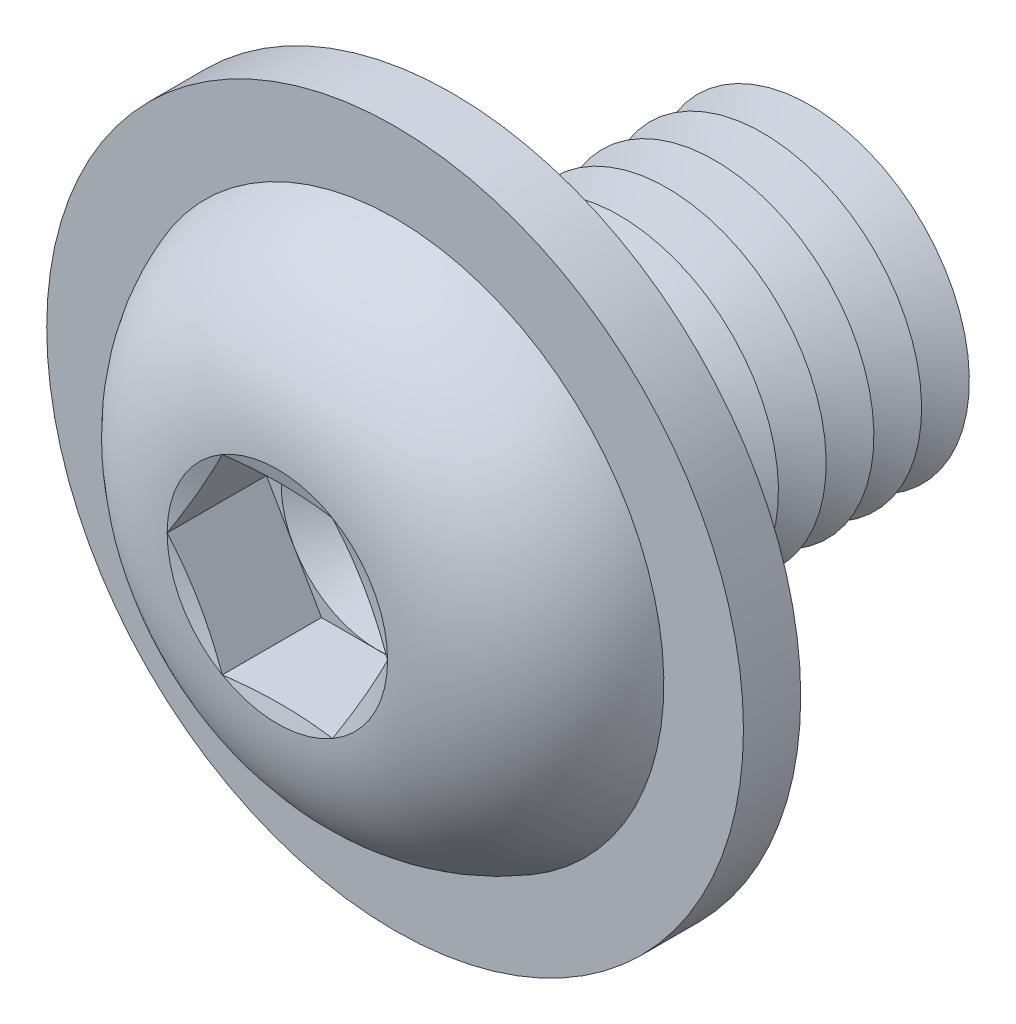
ISO-10303-21;
HEADER;
FILE_DESCRIPTION(('STEP AP214'),'2;1');
FILE_NAME('part.step','',(''),(''),'','','');
FILE_SCHEMA(('AUTOMOTIVE_DESIGN { 1 0 10303 214 1 1 1 1 }'));
ENDSEC;
DATA;
#1=APPLICATION_CONTEXT('core data for automotive mechanical design processes');
#2=APPLICATION_PROTOCOL_DEFINITION('international standard','automotive_design',2000,#1);
#3=PRODUCT_CONTEXT('',#1,'mechanical');
#4=PRODUCT('Part','Part','',(#3));
#5=PRODUCT_RELATED_PRODUCT_CATEGORY('part','',(#4));
#6=PRODUCT_DEFINITION_FORMATION('','',#4);
#7=PRODUCT_DEFINITION_CONTEXT('part definition',#1,'design');
#8=PRODUCT_DEFINITION('design','',#6,#7);
#9=PRODUCT_DEFINITION_SHAPE('','',#8);
#10=(LENGTH_UNIT() NAMED_UNIT(*) SI_UNIT(.MILLI.,.METRE.));
#11=(NAMED_UNIT(*) PLANE_ANGLE_UNIT() SI_UNIT($,.RADIAN.));
#12=(NAMED_UNIT(*) SI_UNIT($,.STERADIAN.) SOLID_ANGLE_UNIT());
#13=UNCERTAINTY_MEASURE_WITH_UNIT(LENGTH_MEASURE(1.E-05),#10,'distance_accuracy_value','');
#14=(GEOMETRIC_REPRESENTATION_CONTEXT(3) GLOBAL_UNCERTAINTY_ASSIGNED_CONTEXT((#13)) GLOBAL_UNIT_ASSIGNED_CONTEXT((#10,
#11,#12)) REPRESENTATION_CONTEXT('',''));
#15=CARTESIAN_POINT('',(0.,0.,0.));
#16=DIRECTION('',(0.,0.,1.));
#17=DIRECTION('',(1.,0.,0.));
#18=AXIS2_PLACEMENT_3D('',#15,#16,#17);
#19=CARTESIAN_POINT('',(0.,0.,-6.74999999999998));
#20=DIRECTION('',(0.,0.,1.));
#21=DIRECTION('',(0.,-1.,0.));
#22=AXIS2_PLACEMENT_3D('',#19,#20,#21);
#23=CONICAL_SURFACE('',#22,4.99999999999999,1.0471975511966);
#24=CARTESIAN_POINT('',(0.,0.,-7.49999999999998));
#25=DIRECTION('',(0.,0.,1.));
#26=DIRECTION('',(0.,-1.,0.));
#27=AXIS2_PLACEMENT_3D('',#24,#25,#26);
#28=CIRCLE('',#27,3.70096189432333);
#29=CARTESIAN_POINT('',(0.,-3.70096189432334,-7.49999999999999));
#30=VERTEX_POINT('',#29);
#31=EDGE_CURVE('E338',#30,#30,#28,.T.);
#32=ORIENTED_EDGE('',*,*,#31,.T.);
#33=EDGE_LOOP('',(#32));
#34=FACE_BOUND('',#33,.T.);
#35=CARTESIAN_POINT('',(0.,0.,-6.74999999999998));
#36=DIRECTION('',(0.,0.,1.));
#37=DIRECTION('',(0.,-1.,0.));
#38=AXIS2_PLACEMENT_3D('',#35,#36,#37);
#39=CIRCLE('',#38,4.99999999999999);
#40=CARTESIAN_POINT('',(0.,-5.,-6.74999999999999));
#41=VERTEX_POINT('',#40);
#42=EDGE_CURVE('E792',#41,#41,#39,.T.);
#43=ORIENTED_EDGE('',*,*,#42,.F.);
#44=EDGE_LOOP('',(#43));
#45=FACE_BOUND('',#44,.T.);
#46=ADVANCED_FACE('F39',(#34,#45),#23,.T.);
#47=CARTESIAN_POINT('',(0.,0.,-7.49999999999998));
#48=DIRECTION('',(0.,0.,-1.));
#49=DIRECTION('',(0.,1.,0.));
#50=AXIS2_PLACEMENT_3D('',#47,#48,#49);
#51=CONICAL_SURFACE('',#50,3.70096189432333,1.0471975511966);
#52=CARTESIAN_POINT('',(0.,0.,-8.24999999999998));
#53=DIRECTION('',(0.,0.,1.));
#54=DIRECTION('',(0.,-1.,0.));
#55=AXIS2_PLACEMENT_3D('',#52,#53,#54);
#56=CIRCLE('',#55,4.99999999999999);
#57=CARTESIAN_POINT('',(0.,-5.,-8.24999999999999));
#58=VERTEX_POINT('',#57);
#59=EDGE_CURVE('E326',#58,#58,#56,.T.);
#60=ORIENTED_EDGE('',*,*,#59,.T.);
#61=EDGE_LOOP('',(#60));
#62=FACE_BOUND('',#61,.T.);
#63=ORIENTED_EDGE('',*,*,#31,.F.);
#64=EDGE_LOOP('',(#63));
#65=FACE_BOUND('',#64,.T.);
#66=ADVANCED_FACE('F370',(#62,#65),#51,.T.);
#67=CARTESIAN_POINT('',(0.,4.99999999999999,-12.));
#68=DIRECTION('',(0.,0.,-1.));
#69=DIRECTION('',(0.,1.,0.));
#70=AXIS2_PLACEMENT_3D('',#67,#68,#69);
#71=PLANE('',#70);
#72=CARTESIAN_POINT('',(0.,0.,-12.));
#73=DIRECTION('',(0.,0.,1.));
#74=DIRECTION('',(0.,-1.,0.));
#75=AXIS2_PLACEMENT_3D('',#72,#73,#74);
#76=CIRCLE('',#75,3.70096189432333);
#77=CARTESIAN_POINT('',(0.,-3.70096189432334,-12.));
#78=VERTEX_POINT('',#77);
#79=EDGE_CURVE('E297',#78,#78,#76,.T.);
#80=ORIENTED_EDGE('',*,*,#79,.F.);
#81=EDGE_LOOP('',(#80));
#82=FACE_BOUND('',#81,.T.);
#83=ADVANCED_FACE('F368',(#82),#71,.T.);
#84=CARTESIAN_POINT('',(0.,0.,-11.25));
#85=DIRECTION('',(0.,0.,1.));
#86=DIRECTION('',(0.,-1.,0.));
#87=AXIS2_PLACEMENT_3D('',#84,#85,#86);
#88=CONICAL_SURFACE('',#87,4.99999999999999,1.0471975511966);
#89=ORIENTED_EDGE('',*,*,#79,.T.);
#90=EDGE_LOOP('',(#89));
#91=FACE_BOUND('',#90,.T.);
#92=CARTESIAN_POINT('',(0.,0.,-11.25));
#93=DIRECTION('',(0.,0.,1.));
#94=DIRECTION('',(0.,-1.,0.));
#95=AXIS2_PLACEMENT_3D('',#92,#93,#94);
#96=CIRCLE('',#95,4.99999999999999);
#97=CARTESIAN_POINT('',(0.,-4.99999999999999,-11.25));
#98=VERTEX_POINT('',#97);
#99=EDGE_CURVE('E355',#98,#98,#96,.T.);
#100=ORIENTED_EDGE('',*,*,#99,.F.);
#101=EDGE_LOOP('',(#100));
#102=FACE_BOUND('',#101,.T.);
#103=ADVANCED_FACE('F365',(#91,#102),#88,.T.);
#104=CARTESIAN_POINT('',(0.,0.,-10.5));
#105=DIRECTION('',(0.,0.,-1.));
#106=DIRECTION('',(0.,1.,0.));
#107=AXIS2_PLACEMENT_3D('',#104,#105,#106);
#108=CONICAL_SURFACE('',#107,3.70096189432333,1.0471975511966);
#109=ORIENTED_EDGE('',*,*,#99,.T.);
#110=EDGE_LOOP('',(#109));
#111=FACE_BOUND('',#110,.T.);
#112=CARTESIAN_POINT('',(0.,0.,-10.5));
#113=DIRECTION('',(0.,0.,1.));
#114=DIRECTION('',(0.,-1.,0.));
#115=AXIS2_PLACEMENT_3D('',#112,#113,#114);
#116=CIRCLE('',#115,3.70096189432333);
#117=CARTESIAN_POINT('',(0.,-3.70096189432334,-10.5));
#118=VERTEX_POINT('',#117);
#119=EDGE_CURVE('E349',#118,#118,#116,.T.);
#120=ORIENTED_EDGE('',*,*,#119,.F.);
#121=EDGE_LOOP('',(#120));
#122=FACE_BOUND('',#121,.T.);
#123=ADVANCED_FACE('F375',(#111,#122),#108,.T.);
#124=CARTESIAN_POINT('',(0.,0.,-9.74999999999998));
#125=DIRECTION('',(0.,0.,1.));
#126=DIRECTION('',(0.,-1.,0.));
#127=AXIS2_PLACEMENT_3D('',#124,#125,#126);
#128=CONICAL_SURFACE('',#127,4.99999999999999,1.0471975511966);
#129=ORIENTED_EDGE('',*,*,#119,.T.);
#130=EDGE_LOOP('',(#129));
#131=FACE_BOUND('',#130,.T.);
#132=CARTESIAN_POINT('',(0.,0.,-9.74999999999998));
#133=DIRECTION('',(0.,0.,1.));
#134=DIRECTION('',(0.,-1.,0.));
#135=AXIS2_PLACEMENT_3D('',#132,#133,#134);
#136=CIRCLE('',#135,4.99999999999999);
#137=CARTESIAN_POINT('',(0.,-5.,-9.74999999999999));
#138=VERTEX_POINT('',#137);
#139=EDGE_CURVE('E325',#138,#138,#136,.T.);
#140=ORIENTED_EDGE('',*,*,#139,.F.);
#141=EDGE_LOOP('',(#140));
#142=FACE_BOUND('',#141,.T.);
#143=ADVANCED_FACE('F392',(#131,#142),#128,.T.);
#144=CARTESIAN_POINT('',(0.,0.,-8.99999999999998));
#145=DIRECTION('',(0.,0.,-1.));
#146=DIRECTION('',(0.,1.,0.));
#147=AXIS2_PLACEMENT_3D('',#144,#145,#146);
#148=CONICAL_SURFACE('',#147,3.70096189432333,1.0471975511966);
#149=ORIENTED_EDGE('',*,*,#139,.T.);
#150=EDGE_LOOP('',(#149));
#151=FACE_BOUND('',#150,.T.);
#152=CARTESIAN_POINT('',(0.,0.,-8.99999999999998));
#153=DIRECTION('',(0.,0.,1.));
#154=DIRECTION('',(0.,-1.,0.));
#155=AXIS2_PLACEMENT_3D('',#152,#153,#154);
#156=CIRCLE('',#155,3.70096189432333);
#157=CARTESIAN_POINT('',(0.,-3.70096189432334,-8.99999999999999));
#158=VERTEX_POINT('',#157);
#159=EDGE_CURVE('E322',#158,#158,#156,.T.);
#160=ORIENTED_EDGE('',*,*,#159,.F.);
#161=EDGE_LOOP('',(#160));
#162=FACE_BOUND('',#161,.T.);
#163=ADVANCED_FACE('F388',(#151,#162),#148,.T.);
#164=CARTESIAN_POINT('',(0.,0.,-8.24999999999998));
#165=DIRECTION('',(0.,0.,1.));
#166=DIRECTION('',(0.,-1.,0.));
#167=AXIS2_PLACEMENT_3D('',#164,#165,#166);
#168=CONICAL_SURFACE('',#167,4.99999999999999,1.0471975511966);
#169=ORIENTED_EDGE('',*,*,#159,.T.);
#170=EDGE_LOOP('',(#169));
#171=FACE_BOUND('',#170,.T.);
#172=ORIENTED_EDGE('',*,*,#59,.F.);
#173=EDGE_LOOP('',(#172));
#174=FACE_BOUND('',#173,.T.);
#175=ADVANCED_FACE('F391',(#171,#174),#168,.T.);
#176=CARTESIAN_POINT('',(0.,0.,-5.24999999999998));
#177=DIRECTION('',(0.,0.,1.));
#178=DIRECTION('',(0.,-1.,0.));
#179=AXIS2_PLACEMENT_3D('',#176,#177,#178);
#180=CONICAL_SURFACE('',#179,4.99999999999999,1.0471975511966);
#181=CARTESIAN_POINT('',(0.,0.,-5.99999999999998));
#182=DIRECTION('',(0.,0.,1.));
#183=DIRECTION('',(0.,-1.,0.));
#184=AXIS2_PLACEMENT_3D('',#181,#182,#183);
#185=CIRCLE('',#184,3.70096189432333);
#186=CARTESIAN_POINT('',(0.,-3.70096189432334,-5.99999999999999));
#187=VERTEX_POINT('',#186);
#188=EDGE_CURVE('E789',#187,#187,#185,.T.);
#189=ORIENTED_EDGE('',*,*,#188,.T.);
#190=EDGE_LOOP('',(#189));
#191=FACE_BOUND('',#190,.T.);
#192=CARTESIAN_POINT('',(0.,0.,-5.24999999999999));
#193=DIRECTION('',(0.,0.,1.));
#194=DIRECTION('',(0.,-1.,0.));
#195=AXIS2_PLACEMENT_3D('',#192,#193,#194);
#196=CIRCLE('',#195,4.99999999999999);
#197=CARTESIAN_POINT('',(0.,-5.,-5.24999999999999));
#198=VERTEX_POINT('',#197);
#199=EDGE_CURVE('E333',#198,#198,#196,.T.);
#200=ORIENTED_EDGE('',*,*,#199,.F.);
#201=EDGE_LOOP('',(#200));
#202=FACE_BOUND('',#201,.T.);
#203=ADVANCED_FACE('F395',(#191,#202),#180,.T.);
#204=CARTESIAN_POINT('',(0.,0.,-5.99999999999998));
#205=DIRECTION('',(0.,0.,-1.));
#206=DIRECTION('',(0.,1.,0.));
#207=AXIS2_PLACEMENT_3D('',#204,#205,#206);
#208=CONICAL_SURFACE('',#207,3.70096189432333,1.0471975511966);
#209=ORIENTED_EDGE('',*,*,#42,.T.);
#210=EDGE_LOOP('',(#209));
#211=FACE_BOUND('',#210,.T.);
#212=ORIENTED_EDGE('',*,*,#188,.F.);
#213=EDGE_LOOP('',(#212));
#214=FACE_BOUND('',#213,.T.);
#215=ADVANCED_FACE('F419',(#211,#214),#208,.T.);
#216=CARTESIAN_POINT('',(0.,0.,-3.74999999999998));
#217=DIRECTION('',(0.,0.,1.));
#218=DIRECTION('',(0.,-1.,0.));
#219=AXIS2_PLACEMENT_3D('',#216,#217,#218);
#220=CONICAL_SURFACE('',#219,4.99999999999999,1.0471975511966);
#221=CARTESIAN_POINT('',(0.,0.,-4.49999999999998));
#222=DIRECTION('',(0.,0.,1.));
#223=DIRECTION('',(0.,-1.,0.));
#224=AXIS2_PLACEMENT_3D('',#221,#222,#223);
#225=CIRCLE('',#224,3.70096189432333);
#226=CARTESIAN_POINT('',(0.,-3.70096189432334,-4.49999999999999));
#227=VERTEX_POINT('',#226);
#228=EDGE_CURVE('E330',#227,#227,#225,.T.);
#229=ORIENTED_EDGE('',*,*,#228,.T.);
#230=EDGE_LOOP('',(#229));
#231=FACE_BOUND('',#230,.T.);
#232=CARTESIAN_POINT('',(0.,0.,-3.74999999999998));
#233=DIRECTION('',(0.,0.,1.));
#234=DIRECTION('',(0.,-1.,0.));
#235=AXIS2_PLACEMENT_3D('',#232,#233,#234);
#236=CIRCLE('',#235,4.99999999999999);
#237=CARTESIAN_POINT('',(0.,-5.,-3.74999999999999));
#238=VERTEX_POINT('',#237);
#239=EDGE_CURVE('E334',#238,#238,#236,.T.);
#240=ORIENTED_EDGE('',*,*,#239,.F.);
#241=EDGE_LOOP('',(#240));
#242=FACE_BOUND('',#241,.T.);
#243=ADVANCED_FACE('F425',(#231,#242),#220,.T.);
#244=CARTESIAN_POINT('',(0.,0.,-4.49999999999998));
#245=DIRECTION('',(0.,0.,-1.));
#246=DIRECTION('',(0.,1.,0.));
#247=AXIS2_PLACEMENT_3D('',#244,#245,#246);
#248=CONICAL_SURFACE('',#247,3.70096189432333,1.0471975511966);
#249=ORIENTED_EDGE('',*,*,#199,.T.);
#250=EDGE_LOOP('',(#249));
#251=FACE_BOUND('',#250,.T.);
#252=ORIENTED_EDGE('',*,*,#228,.F.);
#253=EDGE_LOOP('',(#252));
#254=FACE_BOUND('',#253,.T.);
#255=ADVANCED_FACE('F432',(#251,#254),#248,.T.);
#256=CARTESIAN_POINT('',(0.,0.,-2.24999999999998));
#257=DIRECTION('',(0.,0.,1.));
#258=DIRECTION('',(0.,-1.,0.));
#259=AXIS2_PLACEMENT_3D('',#256,#257,#258);
#260=CONICAL_SURFACE('',#259,4.99999999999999,1.0471975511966);
#261=CARTESIAN_POINT('',(0.,0.,-2.99999999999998));
#262=DIRECTION('',(0.,0.,1.));
#263=DIRECTION('',(0.,-1.,0.));
#264=AXIS2_PLACEMENT_3D('',#261,#262,#263);
#265=CIRCLE('',#264,3.70096189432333);
#266=CARTESIAN_POINT('',(0.,-3.70096189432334,-2.99999999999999));
#267=VERTEX_POINT('',#266);
#268=EDGE_CURVE('E345',#267,#267,#265,.T.);
#269=ORIENTED_EDGE('',*,*,#268,.T.);
#270=EDGE_LOOP('',(#269));
#271=FACE_BOUND('',#270,.T.);
#272=CARTESIAN_POINT('',(0.,0.,-2.24999999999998));
#273=DIRECTION('',(0.,0.,1.));
#274=DIRECTION('',(0.,-1.,0.));
#275=AXIS2_PLACEMENT_3D('',#272,#273,#274);
#276=CIRCLE('',#275,4.99999999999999);
#277=CARTESIAN_POINT('',(0.,-5.,-2.24999999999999));
#278=VERTEX_POINT('',#277);
#279=EDGE_CURVE('E346',#278,#278,#276,.T.);
#280=ORIENTED_EDGE('',*,*,#279,.F.);
#281=EDGE_LOOP('',(#280));
#282=FACE_BOUND('',#281,.T.);
#283=ADVANCED_FACE('F439',(#271,#282),#260,.T.);
#284=CARTESIAN_POINT('',(0.,0.,-2.99999999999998));
#285=DIRECTION('',(0.,0.,-1.));
#286=DIRECTION('',(0.,1.,0.));
#287=AXIS2_PLACEMENT_3D('',#284,#285,#286);
#288=CONICAL_SURFACE('',#287,3.70096189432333,1.0471975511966);
#289=ORIENTED_EDGE('',*,*,#239,.T.);
#290=EDGE_LOOP('',(#289));
#291=FACE_BOUND('',#290,.T.);
#292=ORIENTED_EDGE('',*,*,#268,.F.);
#293=EDGE_LOOP('',(#292));
#294=FACE_BOUND('',#293,.T.);
#295=ADVANCED_FACE('F446',(#291,#294),#288,.T.);
#296=CARTESIAN_POINT('',(0.,0.,-0.749999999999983));
#297=DIRECTION('',(0.,0.,1.));
#298=DIRECTION('',(0.,-1.,0.));
#299=AXIS2_PLACEMENT_3D('',#296,#297,#298);
#300=CONICAL_SURFACE('',#299,4.99999999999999,1.0471975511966);
#301=CARTESIAN_POINT('',(0.,0.,-1.49999999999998));
#302=DIRECTION('',(0.,0.,1.));
#303=DIRECTION('',(0.,-1.,0.));
#304=AXIS2_PLACEMENT_3D('',#301,#302,#303);
#305=CIRCLE('',#304,3.70096189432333);
#306=CARTESIAN_POINT('',(0.,-3.70096189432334,-1.49999999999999));
#307=VERTEX_POINT('',#306);
#308=EDGE_CURVE('E227',#307,#307,#305,.T.);
#309=ORIENTED_EDGE('',*,*,#308,.T.);
#310=EDGE_LOOP('',(#309));
#311=FACE_BOUND('',#310,.T.);
#312=CARTESIAN_POINT('',(0.,0.,-0.749999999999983));
#313=DIRECTION('',(0.,0.,1.));
#314=DIRECTION('',(0.,-1.,0.));
#315=AXIS2_PLACEMENT_3D('',#312,#313,#314);
#316=CIRCLE('',#315,4.99999999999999);
#317=CARTESIAN_POINT('',(0.,-5.,-0.749999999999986));
#318=VERTEX_POINT('',#317);
#319=EDGE_CURVE('E342',#318,#318,#316,.T.);
#320=ORIENTED_EDGE('',*,*,#319,.F.);
#321=EDGE_LOOP('',(#320));
#322=FACE_BOUND('',#321,.T.);
#323=ADVANCED_FACE('F453',(#311,#322),#300,.T.);
#324=CARTESIAN_POINT('',(0.,0.,-1.49999999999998));
#325=DIRECTION('',(0.,0.,-1.));
#326=DIRECTION('',(0.,1.,0.));
#327=AXIS2_PLACEMENT_3D('',#324,#325,#326);
#328=CONICAL_SURFACE('',#327,3.70096189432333,1.0471975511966);
#329=ORIENTED_EDGE('',*,*,#279,.T.);
#330=EDGE_LOOP('',(#329));
#331=FACE_BOUND('',#330,.T.);
#332=ORIENTED_EDGE('',*,*,#308,.F.);
#333=EDGE_LOOP('',(#332));
#334=FACE_BOUND('',#333,.T.);
#335=ADVANCED_FACE('F211',(#331,#334),#328,.T.);
#336=CARTESIAN_POINT('',(0.,4.99999999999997,0.));
#337=DIRECTION('',(0.,0.,-1.));
#338=DIRECTION('',(0.,1.,0.));
#339=AXIS2_PLACEMENT_3D('',#336,#337,#338);
#340=PLANE('',#339);
#341=CARTESIAN_POINT('',(0.,0.,0.));
#342=DIRECTION('',(0.,0.,-1.));
#343=DIRECTION('',(0.,1.,0.));
#344=AXIS2_PLACEMENT_3D('',#341,#342,#343);
#345=CIRCLE('',#344,5.74999999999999);
#346=CARTESIAN_POINT('',(0.,5.74999999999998,0.));
#347=VERTEX_POINT('',#346);
#348=EDGE_CURVE('E281',#347,#347,#345,.F.);
#349=ORIENTED_EDGE('',*,*,#348,.T.);
#350=EDGE_LOOP('',(#349));
#351=FACE_BOUND('',#350,.T.);
#352=CARTESIAN_POINT('',(0.,0.,0.));
#353=DIRECTION('',(0.,0.,-1.));
#354=DIRECTION('',(0.,1.,0.));
#355=AXIS2_PLACEMENT_3D('',#352,#353,#354);
#356=CIRCLE('',#355,10.95);
#357=CARTESIAN_POINT('',(0.,10.95,0.));
#358=VERTEX_POINT('',#357);
#359=EDGE_CURVE('E769',#358,#358,#356,.T.);
#360=ORIENTED_EDGE('',*,*,#359,.T.);
#361=EDGE_LOOP('',(#360));
#362=FACE_BOUND('',#361,.T.);
#363=ADVANCED_FACE('F465',(#351,#362),#340,.T.);
#364=CARTESIAN_POINT('',(0.,0.,-0.750000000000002));
#365=DIRECTION('',(0.,0.,-1.));
#366=DIRECTION('',(0.,1.,0.));
#367=AXIS2_PLACEMENT_3D('',#364,#365,#366);
#368=TOROIDAL_SURFACE('',#367,5.74999999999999,0.75);
#369=ORIENTED_EDGE('',*,*,#348,.F.);
#370=EDGE_LOOP('',(#369));
#371=FACE_BOUND('',#370,.T.);
#372=ORIENTED_EDGE('',*,*,#319,.T.);
#373=EDGE_LOOP('',(#372));
#374=FACE_BOUND('',#373,.T.);
#375=ADVANCED_FACE('F41',(#371,#374),#368,.F.);
#376=CARTESIAN_POINT('',(0.,0.,1.8));
#377=DIRECTION('',(0.,0.,-1.));
#378=DIRECTION('',(0.,1.,0.));
#379=AXIS2_PLACEMENT_3D('',#376,#377,#378);
#380=CYLINDRICAL_SURFACE('',#379,10.95);
#381=CARTESIAN_POINT('',(0.,0.,1.8));
#382=DIRECTION('',(0.,0.,-1.));
#383=DIRECTION('',(0.,1.,0.));
#384=AXIS2_PLACEMENT_3D('',#381,#382,#383);
#385=CIRCLE('',#384,10.95);
#386=CARTESIAN_POINT('',(0.,10.95,1.8));
#387=VERTEX_POINT('',#386);
#388=EDGE_CURVE('E765',#387,#387,#385,.T.);
#389=ORIENTED_EDGE('',*,*,#388,.T.);
#390=EDGE_LOOP('',(#389));
#391=FACE_BOUND('',#390,.T.);
#392=ORIENTED_EDGE('',*,*,#359,.F.);
#393=EDGE_LOOP('',(#392));
#394=FACE_BOUND('',#393,.T.);
#395=ADVANCED_FACE('F475',(#391,#394),#380,.T.);
#396=CARTESIAN_POINT('',(0.,0.,1.8));
#397=DIRECTION('',(0.,0.,-1.));
#398=DIRECTION('',(0.,1.,0.));
#399=AXIS2_PLACEMENT_3D('',#396,#397,#398);
#400=PLANE('',#399);
#401=CARTESIAN_POINT('',(0.,0.,1.8));
#402=DIRECTION('',(0.,0.,-1.));
#403=DIRECTION('',(0.,1.,0.));
#404=AXIS2_PLACEMENT_3D('',#401,#402,#403);
#405=CIRCLE('',#404,8.4473670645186);
#406=CARTESIAN_POINT('',(0.,8.44736706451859,1.8));
#407=VERTEX_POINT('',#406);
#408=EDGE_CURVE('E43',#407,#407,#405,.F.);
#409=ORIENTED_EDGE('',*,*,#408,.F.);
#410=EDGE_LOOP('',(#409));
#411=FACE_BOUND('',#410,.T.);
#412=ORIENTED_EDGE('',*,*,#388,.F.);
#413=EDGE_LOOP('',(#412));
#414=FACE_BOUND('',#413,.T.);
#415=ADVANCED_FACE('F117',(#411,#414),#400,.F.);
#416=CARTESIAN_POINT('',(0.,0.,2.38));
#417=DIRECTION('',(0.,0.,1.));
#418=DIRECTION('',(1.,0.,0.));
#419=AXIS2_PLACEMENT_3D('',#416,#417,#418);
#420=CONICAL_SURFACE('',#419,2.99999860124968,1.0471975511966);
#421=CARTESIAN_POINT('',(0.,0.,0.647950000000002));
#422=VERTEX_POINT('',#421);
#423=VERTEX_LOOP('',#422);
#424=FACE_BOUND('',#423,.T.);
#425=CARTESIAN_POINT('',(0.,0.,2.38));
#426=DIRECTION('',(0.,0.,1.));
#427=DIRECTION('',(1.,0.,0.));
#428=AXIS2_PLACEMENT_3D('',#425,#426,#427);
#429=CIRCLE('',#428,2.99999860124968);
#430=CARTESIAN_POINT('',(2.59807500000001,1.49999930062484,2.38));
#431=VERTEX_POINT('',#430);
#432=CARTESIAN_POINT('',(0.,2.99999860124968,2.38));
#433=VERTEX_POINT('',#432);
#434=EDGE_CURVE('E120',#431,#433,#429,.T.);
#435=ORIENTED_EDGE('',*,*,#434,.T.);
#436=CARTESIAN_POINT('',(0.,0.,2.38));
#437=DIRECTION('',(0.,0.,1.));
#438=DIRECTION('',(1.,0.,0.));
#439=AXIS2_PLACEMENT_3D('',#436,#437,#438);
#440=CIRCLE('',#439,2.99999860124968);
#441=CARTESIAN_POINT('',(-2.59807500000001,1.49999930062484,2.38));
#442=VERTEX_POINT('',#441);
#443=EDGE_CURVE('E11',#433,#442,#440,.T.);
#444=ORIENTED_EDGE('',*,*,#443,.T.);
#445=CARTESIAN_POINT('',(-2.59807500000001,-1.49999930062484,2.38));
#446=VERTEX_POINT('',#445);
#447=EDGE_CURVE('E49',#442,#446,#440,.T.);
#448=ORIENTED_EDGE('',*,*,#447,.T.);
#449=CARTESIAN_POINT('',(0.,-2.99999860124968,2.38));
#450=VERTEX_POINT('',#449);
#451=EDGE_CURVE('E284',#446,#450,#440,.T.);
#452=ORIENTED_EDGE('',*,*,#451,.T.);
#453=CARTESIAN_POINT('',(2.59807500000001,-1.49999930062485,2.38));
#454=VERTEX_POINT('',#453);
#455=EDGE_CURVE('E57',#450,#454,#440,.T.);
#456=ORIENTED_EDGE('',*,*,#455,.T.);
#457=EDGE_CURVE('E50',#454,#431,#440,.T.);
#458=ORIENTED_EDGE('',*,*,#457,.T.);
#459=EDGE_LOOP('',(#435,#444,#448,#452,#456,#458));
#460=FACE_BOUND('',#459,.T.);
#461=ADVANCED_FACE('F114',(#424,#460),#420,.F.);
#462=CARTESIAN_POINT('',(0.,0.,2.38));
#463=DIRECTION('',(0.,0.,1.));
#464=DIRECTION('',(1.,0.,0.));
#465=AXIS2_PLACEMENT_3D('',#462,#463,#464);
#466=PLANE('',#465);
#467=ORIENTED_EDGE('',*,*,#443,.F.);
#468=DIRECTION('',(-1.,0.,0.));
#469=VECTOR('',#468,1.);
#470=CARTESIAN_POINT('',(1.73205000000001,2.99999860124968,2.38));
#471=LINE('',#470,#469);
#472=CARTESIAN_POINT('',(-1.73205000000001,2.99999860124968,2.38));
#473=VERTEX_POINT('',#472);
#474=EDGE_CURVE('E132',#433,#473,#471,.T.);
#475=ORIENTED_EDGE('',*,*,#474,.T.);
#476=DIRECTION('',(-0.5,-0.866025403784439,0.));
#477=VECTOR('',#476,1.);
#478=CARTESIAN_POINT('',(-1.73205000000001,2.99999860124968,2.38));
#479=LINE('',#478,#477);
#480=EDGE_CURVE('E135',#473,#442,#479,.T.);
#481=ORIENTED_EDGE('',*,*,#480,.T.);
#482=EDGE_LOOP('',(#467,#475,#481));
#483=FACE_BOUND('',#482,.T.);
#484=ADVANCED_FACE('F116',(#483),#466,.T.);
#485=ORIENTED_EDGE('',*,*,#447,.F.);
#486=CARTESIAN_POINT('',(-3.46410000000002,0.,2.38));
#487=VERTEX_POINT('',#486);
#488=EDGE_CURVE('E145',#442,#487,#479,.T.);
#489=ORIENTED_EDGE('',*,*,#488,.T.);
#490=DIRECTION('',(0.5,-0.866025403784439,0.));
#491=VECTOR('',#490,1.);
#492=CARTESIAN_POINT('',(-3.46410000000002,0.,2.38));
#493=LINE('',#492,#491);
#494=EDGE_CURVE('E154',#487,#446,#493,.T.);
#495=ORIENTED_EDGE('',*,*,#494,.T.);
#496=EDGE_LOOP('',(#485,#489,#495));
#497=FACE_BOUND('',#496,.T.);
#498=ADVANCED_FACE('F496',(#497),#466,.T.);
#499=ORIENTED_EDGE('',*,*,#451,.F.);
#500=CARTESIAN_POINT('',(-1.73205000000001,-2.99999860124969,2.38));
#501=VERTEX_POINT('',#500);
#502=EDGE_CURVE('E153',#446,#501,#493,.T.);
#503=ORIENTED_EDGE('',*,*,#502,.T.);
#504=DIRECTION('',(1.,0.,0.));
#505=VECTOR('',#504,1.);
#506=CARTESIAN_POINT('',(-1.73205000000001,-2.99999860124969,2.38));
#507=LINE('',#506,#505);
#508=EDGE_CURVE('E159',#501,#450,#507,.T.);
#509=ORIENTED_EDGE('',*,*,#508,.T.);
#510=EDGE_LOOP('',(#499,#503,#509));
#511=FACE_BOUND('',#510,.T.);
#512=ADVANCED_FACE('F501',(#511),#466,.T.);
#513=ORIENTED_EDGE('',*,*,#455,.F.);
#514=CARTESIAN_POINT('',(1.73205000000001,-2.99999860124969,2.38));
#515=VERTEX_POINT('',#514);
#516=EDGE_CURVE('E158',#450,#515,#507,.T.);
#517=ORIENTED_EDGE('',*,*,#516,.T.);
#518=DIRECTION('',(0.5,0.866025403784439,0.));
#519=VECTOR('',#518,1.);
#520=CARTESIAN_POINT('',(1.73205000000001,-2.99999860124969,2.38));
#521=LINE('',#520,#519);
#522=EDGE_CURVE('E164',#515,#454,#521,.T.);
#523=ORIENTED_EDGE('',*,*,#522,.T.);
#524=EDGE_LOOP('',(#513,#517,#523));
#525=FACE_BOUND('',#524,.T.);
#526=ADVANCED_FACE('F507',(#525),#466,.T.);
#527=ORIENTED_EDGE('',*,*,#457,.F.);
#528=CARTESIAN_POINT('',(3.46410000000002,0.,2.38));
#529=VERTEX_POINT('',#528);
#530=EDGE_CURVE('E163',#454,#529,#521,.T.);
#531=ORIENTED_EDGE('',*,*,#530,.T.);
#532=DIRECTION('',(-0.5,0.866025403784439,0.));
#533=VECTOR('',#532,1.);
#534=CARTESIAN_POINT('',(3.46410000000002,0.,2.38));
#535=LINE('',#534,#533);
#536=EDGE_CURVE('E141',#529,#431,#535,.T.);
#537=ORIENTED_EDGE('',*,*,#536,.T.);
#538=EDGE_LOOP('',(#527,#531,#537));
#539=FACE_BOUND('',#538,.T.);
#540=ADVANCED_FACE('F513',(#539),#466,.T.);
#541=ORIENTED_EDGE('',*,*,#434,.F.);
#542=CARTESIAN_POINT('',(1.73205000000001,2.99999860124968,2.38));
#543=VERTEX_POINT('',#542);
#544=EDGE_CURVE('E127',#431,#543,#535,.T.);
#545=ORIENTED_EDGE('',*,*,#544,.T.);
#546=EDGE_CURVE('E137',#543,#433,#471,.T.);
#547=ORIENTED_EDGE('',*,*,#546,.T.);
#548=EDGE_LOOP('',(#541,#545,#547));
#549=FACE_BOUND('',#548,.T.);
#550=ADVANCED_FACE('F143',(#549),#466,.T.);
#551=CARTESIAN_POINT('',(1.73205000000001,2.99999860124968,2.38));
#552=DIRECTION('',(0.,1.,0.));
#553=DIRECTION('',(-1.,0.,0.));
#554=AXIS2_PLACEMENT_3D('',#551,#552,#553);
#555=PLANE('',#554);
#556=CARTESIAN_POINT('',(5.22730063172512,2.99999860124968,6.18672552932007));
#557=CARTESIAN_POINT('',(5.1007588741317,2.99999860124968,6.15732018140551));
#558=CARTESIAN_POINT('',(4.97415993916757,2.99999860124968,6.12816064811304));
#559=CARTESIAN_POINT('',(4.72082394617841,2.99999860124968,6.07043857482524));
#560=CARTESIAN_POINT('',(4.59408688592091,2.99999860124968,6.04187604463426));
#561=CARTESIAN_POINT('',(4.21358997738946,2.99999860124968,5.95723252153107));
#562=CARTESIAN_POINT('',(3.95959339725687,2.99999860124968,5.90220706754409));
#563=CARTESIAN_POINT('',(3.44835573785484,2.99999860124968,5.79574115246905));
#564=CARTESIAN_POINT('',(3.19110656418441,2.99999860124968,5.74433913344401));
#565=CARTESIAN_POINT('',(2.67540790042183,2.99999860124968,5.6477299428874));
#566=CARTESIAN_POINT('',(2.41695830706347,2.99999860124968,5.60252331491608));
#567=CARTESIAN_POINT('',(1.90555125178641,2.99999860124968,5.52251897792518));
#568=CARTESIAN_POINT('',(1.65263426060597,2.99999860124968,5.48747285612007));
#569=CARTESIAN_POINT('',(1.27220564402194,2.99999860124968,5.44439602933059));
#570=CARTESIAN_POINT('',(1.1452320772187,2.99999860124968,5.43161987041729));
#571=CARTESIAN_POINT('',(0.890973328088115,2.99999860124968,5.40972605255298));
#572=CARTESIAN_POINT('',(0.763688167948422,2.99999860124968,5.40060814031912));
#573=CARTESIAN_POINT('',(0.509442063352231,2.99999860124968,5.38647457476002));
#574=CARTESIAN_POINT('',(0.382482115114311,2.99999860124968,5.38144125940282));
#575=CARTESIAN_POINT('',(0.128463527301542,2.99999860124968,5.37566637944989));
#576=CARTESIAN_POINT('',(0.00140488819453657,2.99999860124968,5.37492479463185));
#577=CARTESIAN_POINT('',(-0.252672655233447,2.99999860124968,5.37777315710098));
#578=CARTESIAN_POINT('',(-0.379691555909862,2.99999860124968,5.38136342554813));
#579=CARTESIAN_POINT('',(-0.633540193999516,2.99999860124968,5.39268816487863));
#580=CARTESIAN_POINT('',(-0.760369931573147,2.99999860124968,5.40042263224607));
#581=CARTESIAN_POINT('',(-1.06836981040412,2.99999860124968,5.42382465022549));
#582=CARTESIAN_POINT('',(-1.24938929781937,2.99999860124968,5.44147485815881));
#583=CARTESIAN_POINT('',(-1.61066786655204,2.99999860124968,5.48312309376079));
#584=CARTESIAN_POINT('',(-1.79092697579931,2.99999860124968,5.50712088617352));
#585=CARTESIAN_POINT('',(-2.15127612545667,2.99999860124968,5.56013471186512));
#586=CARTESIAN_POINT('',(-2.33136383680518,2.99999860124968,5.58916634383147));
#587=CARTESIAN_POINT('',(-2.69089203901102,2.99999860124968,5.65100028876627));
#588=CARTESIAN_POINT('',(-2.870332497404,2.99999860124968,5.68380278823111));
#589=CARTESIAN_POINT('',(-3.23235399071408,2.99999860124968,5.75295369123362));
#590=CARTESIAN_POINT('',(-3.41492365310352,2.99999860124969,5.78936117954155));
#591=CARTESIAN_POINT('',(-3.77960351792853,2.99999860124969,5.864406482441));
#592=CARTESIAN_POINT('',(-3.96171371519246,2.99999860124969,5.90304432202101));
#593=CARTESIAN_POINT('',(-4.32457472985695,2.99999860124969,5.9817966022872));
#594=CARTESIAN_POINT('',(-4.50532755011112,2.99999860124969,6.02190185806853));
#595=CARTESIAN_POINT('',(-4.86652484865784,2.99999860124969,6.10342152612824));
#596=CARTESIAN_POINT('',(-5.04696934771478,2.99999860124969,6.14483584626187));
#597=CARTESIAN_POINT('',(-5.22730063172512,2.99999860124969,6.18672552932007));
#598=B_SPLINE_CURVE_WITH_KNOTS('',3,(#556,#557,#558,#559,#560,#561,#562,#563,#564,#565,#566,
#567,#568,#569,#570,#571,#572,#573,#574,#575,#576,#577,#578,#579,#580,#581,#582,#583,#584,#585,
#586,#587,#588,#589,#590,#591,#592,#593,#594,#595,#596,#597),.UNSPECIFIED.,.F.,.F.,(4,2,2,2,2,2,
2,2,2,2,2,2,2,2,2,2,2,2,2,2,4),(0.,0.389739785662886,0.77948596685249,1.55912928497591,
2.34608117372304,3.13310206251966,3.89884102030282,4.28164148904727,4.66441544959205,
5.04552531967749,5.42663339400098,5.80776972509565,6.18890573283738,6.734389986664,
7.27985402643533,7.82703956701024,8.37425218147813,8.93272720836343,9.49120849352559,
10.0466490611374,10.6020506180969),.UNSPECIFIED.);
#599=CARTESIAN_POINT('',(1.73204999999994,2.99999860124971,5.5));
#600=VERTEX_POINT('',#599);
#601=CARTESIAN_POINT('',(-1.73205000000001,2.99999860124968,5.5));
#602=VERTEX_POINT('',#601);
#603=EDGE_CURVE('E172',#600,#602,#598,.T.);
#604=ORIENTED_EDGE('',*,*,#603,.T.);
#605=DIRECTION('',(0.,0.,1.));
#606=VECTOR('',#605,1.);
#607=CARTESIAN_POINT('',(-1.73205000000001,2.99999860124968,2.38));
#608=LINE('',#607,#606);
#609=EDGE_CURVE('E139',#473,#602,#608,.T.);
#610=ORIENTED_EDGE('',*,*,#609,.F.);
#611=ORIENTED_EDGE('',*,*,#474,.F.);
#612=ORIENTED_EDGE('',*,*,#546,.F.);
#613=DIRECTION('',(0.,0.,1.));
#614=VECTOR('',#613,1.);
#615=CARTESIAN_POINT('',(1.73205000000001,2.99999860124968,2.38));
#616=LINE('',#615,#614);
#617=EDGE_CURVE('E65',#543,#600,#616,.T.);
#618=ORIENTED_EDGE('',*,*,#617,.T.);
#619=EDGE_LOOP('',(#604,#610,#611,#612,#618));
#620=FACE_BOUND('',#619,.T.);
#621=ADVANCED_FACE('F136',(#620),#555,.F.);
#622=CARTESIAN_POINT('',(-1.73205000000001,2.99999860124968,2.38));
#623=DIRECTION('',(-0.866025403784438,0.5,0.));
#624=DIRECTION('',(-0.5,-0.866025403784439,0.));
#625=AXIS2_PLACEMENT_3D('',#622,#623,#624);
#626=PLANE('',#625);
#627=CARTESIAN_POINT('',(-1.73193452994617,3.00019860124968,5.50003094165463));
#628=CARTESIAN_POINT('',(-1.8038717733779,2.87559964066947,5.48074619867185));
#629=CARTESIAN_POINT('',(-1.87593945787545,2.75077474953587,5.46323875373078));
#630=CARTESIAN_POINT('',(-2.02032937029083,2.50068408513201,5.43247971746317));
#631=CARTESIAN_POINT('',(-2.09265168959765,2.37541815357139,5.41922985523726));
#632=CARTESIAN_POINT('',(-2.23711232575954,2.12520499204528,5.39775958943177));
#633=CARTESIAN_POINT('',(-2.30924966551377,2.00025945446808,5.38951357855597));
#634=CARTESIAN_POINT('',(-2.45361635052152,1.75020902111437,5.37845651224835));
#635=CARTESIAN_POINT('',(-2.52584567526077,1.62510416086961,5.3756444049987));
#636=CARTESIAN_POINT('',(-2.67030432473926,1.37489444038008,5.3756444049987));
#637=CARTESIAN_POINT('',(-2.74253364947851,1.24978958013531,5.37845651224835));
#638=CARTESIAN_POINT('',(-2.88690033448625,0.999739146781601,5.38951357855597));
#639=CARTESIAN_POINT('',(-2.95903767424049,0.874793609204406,5.39775958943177));
#640=CARTESIAN_POINT('',(-3.10349831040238,0.62458044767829,5.41922985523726));
#641=CARTESIAN_POINT('',(-3.17582062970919,0.499314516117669,5.43247971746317));
#642=CARTESIAN_POINT('',(-3.32021054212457,0.249223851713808,5.46323875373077));
#643=CARTESIAN_POINT('',(-3.39227822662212,0.124398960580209,5.48074619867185));
#644=CARTESIAN_POINT('',(-3.46421547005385,-0.000200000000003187,5.50003094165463));
#645=B_SPLINE_CURVE_WITH_KNOTS('',3,(#627,#628,#629,#630,#631,#632,#633,#634,#635,#636,#637,
#638,#639,#640,#641,#642,#643,#644),.UNSPECIFIED.,.F.,.F.,(4,2,2,2,2,2,2,2,4),(0.,
0.435506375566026,0.871189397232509,1.30462357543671,1.73797384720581,2.17132411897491,
2.60475829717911,3.04044131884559,3.47594769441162),.UNSPECIFIED.);
#646=CARTESIAN_POINT('',(-3.46410000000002,0.,5.5));
#647=VERTEX_POINT('',#646);
#648=EDGE_CURVE('E235',#602,#647,#645,.T.);
#649=ORIENTED_EDGE('',*,*,#648,.T.);
#650=DIRECTION('',(0.,0.,1.));
#651=VECTOR('',#650,1.);
#652=CARTESIAN_POINT('',(-3.46410000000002,0.,2.38));
#653=LINE('',#652,#651);
#654=EDGE_CURVE('E174',#487,#647,#653,.T.);
#655=ORIENTED_EDGE('',*,*,#654,.F.);
#656=ORIENTED_EDGE('',*,*,#488,.F.);
#657=ORIENTED_EDGE('',*,*,#480,.F.);
#658=ORIENTED_EDGE('',*,*,#609,.T.);
#659=EDGE_LOOP('',(#649,#655,#656,#657,#658));
#660=FACE_BOUND('',#659,.T.);
#661=ADVANCED_FACE('F202',(#660),#626,.F.);
#662=CARTESIAN_POINT('',(-3.46410000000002,0.,2.38));
#663=DIRECTION('',(-0.866025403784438,-0.5,0.));
#664=DIRECTION('',(0.5,-0.866025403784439,0.));
#665=AXIS2_PLACEMENT_3D('',#662,#663,#664);
#666=PLANE('',#665);
#667=CARTESIAN_POINT('',(-3.46421547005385,0.000199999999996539,5.50003094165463));
#668=CARTESIAN_POINT('',(-3.39227822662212,-0.124398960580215,5.48074619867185));
#669=CARTESIAN_POINT('',(-3.32021054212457,-0.249223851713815,5.46323875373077));
#670=CARTESIAN_POINT('',(-3.17582062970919,-0.499314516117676,5.43247971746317));
#671=CARTESIAN_POINT('',(-3.10349831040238,-0.624580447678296,5.41922985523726));
#672=CARTESIAN_POINT('',(-2.95903767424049,-0.874793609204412,5.39775958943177));
#673=CARTESIAN_POINT('',(-2.88690033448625,-0.999739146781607,5.38951357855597));
#674=CARTESIAN_POINT('',(-2.7425336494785,-1.24978958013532,5.37845651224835));
#675=CARTESIAN_POINT('',(-2.67030432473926,-1.37489444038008,5.37564440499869));
#676=CARTESIAN_POINT('',(-2.52584567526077,-1.62510416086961,5.37564440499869));
#677=CARTESIAN_POINT('',(-2.45361635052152,-1.75020902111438,5.37845651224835));
#678=CARTESIAN_POINT('',(-2.30924966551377,-2.00025945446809,5.38951357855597));
#679=CARTESIAN_POINT('',(-2.23711232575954,-2.12520499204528,5.39775958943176));
#680=CARTESIAN_POINT('',(-2.09265168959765,-2.3754181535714,5.41922985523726));
#681=CARTESIAN_POINT('',(-2.02032937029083,-2.50068408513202,5.43247971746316));
#682=CARTESIAN_POINT('',(-1.87593945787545,-2.75077474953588,5.46323875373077));
#683=CARTESIAN_POINT('',(-1.8038717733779,-2.87559964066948,5.48074619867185));
#684=CARTESIAN_POINT('',(-1.73193452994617,-3.00019860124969,5.50003094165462));
#685=B_SPLINE_CURVE_WITH_KNOTS('',3,(#667,#668,#669,#670,#671,#672,#673,#674,#675,#676,#677,
#678,#679,#680,#681,#682,#683,#684),.UNSPECIFIED.,.F.,.F.,(4,2,2,2,2,2,2,2,4),(0.,
0.435506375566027,0.871189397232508,1.30462357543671,1.73797384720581,2.17132411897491,
2.60475829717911,3.04044131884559,3.47594769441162),.UNSPECIFIED.);
#686=CARTESIAN_POINT('',(-1.73205000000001,-2.99999860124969,5.5));
#687=VERTEX_POINT('',#686);
#688=EDGE_CURVE('E238',#647,#687,#685,.T.);
#689=ORIENTED_EDGE('',*,*,#688,.T.);
#690=DIRECTION('',(0.,0.,1.));
#691=VECTOR('',#690,1.);
#692=CARTESIAN_POINT('',(-1.73205000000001,-2.99999860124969,2.38));
#693=LINE('',#692,#691);
#694=EDGE_CURVE('E178',#501,#687,#693,.T.);
#695=ORIENTED_EDGE('',*,*,#694,.F.);
#696=ORIENTED_EDGE('',*,*,#502,.F.);
#697=ORIENTED_EDGE('',*,*,#494,.F.);
#698=ORIENTED_EDGE('',*,*,#654,.T.);
#699=EDGE_LOOP('',(#689,#695,#696,#697,#698));
#700=FACE_BOUND('',#699,.T.);
#701=ADVANCED_FACE('F256',(#700),#666,.F.);
#702=CARTESIAN_POINT('',(-1.73205000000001,-2.99999860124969,2.38));
#703=DIRECTION('',(0.,-1.,0.));
#704=DIRECTION('',(1.,0.,0.));
#705=AXIS2_PLACEMENT_3D('',#702,#703,#704);
#706=PLANE('',#705);
#707=CARTESIAN_POINT('',(-5.22730063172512,-2.99999860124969,6.18672552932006));
#708=CARTESIAN_POINT('',(-5.1007588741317,-2.99999860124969,6.15732018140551));
#709=CARTESIAN_POINT('',(-4.97415993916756,-2.99999860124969,6.12816064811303));
#710=CARTESIAN_POINT('',(-4.7208239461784,-2.99999860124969,6.07043857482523));
#711=CARTESIAN_POINT('',(-4.59408688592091,-2.99999860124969,6.04187604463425));
#712=CARTESIAN_POINT('',(-4.21358997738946,-2.99999860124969,5.95723252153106));
#713=CARTESIAN_POINT('',(-3.95959339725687,-2.99999860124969,5.90220706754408));
#714=CARTESIAN_POINT('',(-3.44835573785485,-2.99999860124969,5.79574115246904));
#715=CARTESIAN_POINT('',(-3.19110656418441,-2.99999860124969,5.744339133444));
#716=CARTESIAN_POINT('',(-2.67540790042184,-2.99999860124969,5.64772994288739));
#717=CARTESIAN_POINT('',(-2.41695830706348,-2.99999860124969,5.60252331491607));
#718=CARTESIAN_POINT('',(-1.90555125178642,-2.99999860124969,5.52251897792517));
#719=CARTESIAN_POINT('',(-1.65263426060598,-2.99999860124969,5.48747285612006));
#720=CARTESIAN_POINT('',(-1.27220564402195,-2.99999860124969,5.44439602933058));
#721=CARTESIAN_POINT('',(-1.14523207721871,-2.99999860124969,5.43161987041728));
#722=CARTESIAN_POINT('',(-0.890973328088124,-2.99999860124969,5.40972605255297));
#723=CARTESIAN_POINT('',(-0.763688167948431,-2.99999860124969,5.40060814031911));
#724=CARTESIAN_POINT('',(-0.509442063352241,-2.99999860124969,5.38647457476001));
#725=CARTESIAN_POINT('',(-0.382482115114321,-2.99999860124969,5.38144125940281));
#726=CARTESIAN_POINT('',(-0.128463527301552,-2.99999860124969,5.37566637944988));
#727=CARTESIAN_POINT('',(-0.0014048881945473,-2.99999860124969,5.37492479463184));
#728=CARTESIAN_POINT('',(0.252672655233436,-2.99999860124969,5.37777315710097));
#729=CARTESIAN_POINT('',(0.379691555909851,-2.99999860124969,5.38136342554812));
#730=CARTESIAN_POINT('',(0.633540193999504,-2.99999860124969,5.39268816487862));
#731=CARTESIAN_POINT('',(0.760369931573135,-2.99999860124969,5.40042263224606));
#732=CARTESIAN_POINT('',(1.06836981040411,-2.99999860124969,5.42382465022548));
#733=CARTESIAN_POINT('',(1.24938929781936,-2.99999860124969,5.4414748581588));
#734=CARTESIAN_POINT('',(1.61066786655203,-2.99999860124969,5.48312309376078));
#735=CARTESIAN_POINT('',(1.7909269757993,-2.99999860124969,5.50712088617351));
#736=CARTESIAN_POINT('',(2.15127612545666,-2.99999860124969,5.56013471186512));
#737=CARTESIAN_POINT('',(2.33136383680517,-2.99999860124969,5.58916634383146));
#738=CARTESIAN_POINT('',(2.69089203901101,-2.99999860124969,5.65100028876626));
#739=CARTESIAN_POINT('',(2.87033249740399,-2.99999860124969,5.6838027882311));
#740=CARTESIAN_POINT('',(3.23235399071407,-2.99999860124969,5.75295369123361));
#741=CARTESIAN_POINT('',(3.41492365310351,-2.99999860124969,5.78936117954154));
#742=CARTESIAN_POINT('',(3.77960351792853,-2.99999860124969,5.86440648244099));
#743=CARTESIAN_POINT('',(3.96171371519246,-2.99999860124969,5.903044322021));
#744=CARTESIAN_POINT('',(4.32457472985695,-2.99999860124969,5.98179660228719));
#745=CARTESIAN_POINT('',(4.50532755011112,-2.99999860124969,6.02190185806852));
#746=CARTESIAN_POINT('',(4.86652484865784,-2.99999860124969,6.10342152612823));
#747=CARTESIAN_POINT('',(5.04696934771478,-2.99999860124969,6.14483584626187));
#748=CARTESIAN_POINT('',(5.22730063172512,-2.99999860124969,6.18672552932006));
#749=B_SPLINE_CURVE_WITH_KNOTS('',3,(#707,#708,#709,#710,#711,#712,#713,#714,#715,#716,#717,
#718,#719,#720,#721,#722,#723,#724,#725,#726,#727,#728,#729,#730,#731,#732,#733,#734,#735,#736,
#737,#738,#739,#740,#741,#742,#743,#744,#745,#746,#747,#748),.UNSPECIFIED.,.F.,.F.,(4,2,2,2,2,2,
2,2,2,2,2,2,2,2,2,2,2,2,2,2,4),(0.,0.389739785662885,0.779485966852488,1.55912928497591,
2.34608117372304,3.13310206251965,3.89884102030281,4.28164148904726,4.66441544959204,
5.04552531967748,5.42663339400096,5.80776972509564,6.18890573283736,6.73438998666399,
7.27985402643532,7.82703956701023,8.37425218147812,8.93272720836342,9.49120849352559,
10.0466490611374,10.6020506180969),.UNSPECIFIED.);
#750=CARTESIAN_POINT('',(1.73205000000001,-2.99999860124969,5.5));
#751=VERTEX_POINT('',#750);
#752=EDGE_CURVE('E243',#687,#751,#749,.T.);
#753=ORIENTED_EDGE('',*,*,#752,.T.);
#754=DIRECTION('',(0.,0.,1.));
#755=VECTOR('',#754,1.);
#756=CARTESIAN_POINT('',(1.73205000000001,-2.99999860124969,2.38));
#757=LINE('',#756,#755);
#758=EDGE_CURVE('E173',#515,#751,#757,.T.);
#759=ORIENTED_EDGE('',*,*,#758,.F.);
#760=ORIENTED_EDGE('',*,*,#516,.F.);
#761=ORIENTED_EDGE('',*,*,#508,.F.);
#762=ORIENTED_EDGE('',*,*,#694,.T.);
#763=EDGE_LOOP('',(#753,#759,#760,#761,#762));
#764=FACE_BOUND('',#763,.T.);
#765=ADVANCED_FACE('F253',(#764),#706,.F.);
#766=CARTESIAN_POINT('',(1.73205000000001,-2.99999860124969,2.38));
#767=DIRECTION('',(0.866025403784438,-0.5,0.));
#768=DIRECTION('',(0.5,0.866025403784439,0.));
#769=AXIS2_PLACEMENT_3D('',#766,#767,#768);
#770=PLANE('',#769);
#771=CARTESIAN_POINT('',(1.73193452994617,-3.00019860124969,5.50003094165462));
#772=CARTESIAN_POINT('',(1.8038717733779,-2.87559964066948,5.48074619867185));
#773=CARTESIAN_POINT('',(1.87593945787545,-2.75077474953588,5.46323875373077));
#774=CARTESIAN_POINT('',(2.02032937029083,-2.50068408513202,5.43247971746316));
#775=CARTESIAN_POINT('',(2.09265168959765,-2.3754181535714,5.41922985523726));
#776=CARTESIAN_POINT('',(2.23711232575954,-2.12520499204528,5.39775958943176));
#777=CARTESIAN_POINT('',(2.30924966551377,-2.00025945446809,5.38951357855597));
#778=CARTESIAN_POINT('',(2.45361635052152,-1.75020902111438,5.37845651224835));
#779=CARTESIAN_POINT('',(2.52584567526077,-1.62510416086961,5.37564440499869));
#780=CARTESIAN_POINT('',(2.67030432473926,-1.37489444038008,5.37564440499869));
#781=CARTESIAN_POINT('',(2.74253364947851,-1.24978958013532,5.37845651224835));
#782=CARTESIAN_POINT('',(2.88690033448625,-0.999739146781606,5.38951357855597));
#783=CARTESIAN_POINT('',(2.95903767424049,-0.874793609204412,5.39775958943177));
#784=CARTESIAN_POINT('',(3.10349831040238,-0.624580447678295,5.41922985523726));
#785=CARTESIAN_POINT('',(3.17582062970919,-0.499314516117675,5.43247971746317));
#786=CARTESIAN_POINT('',(3.32021054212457,-0.249223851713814,5.46323875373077));
#787=CARTESIAN_POINT('',(3.39227822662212,-0.124398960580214,5.48074619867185));
#788=CARTESIAN_POINT('',(3.46421547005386,0.000199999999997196,5.50003094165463));
#789=B_SPLINE_CURVE_WITH_KNOTS('',3,(#771,#772,#773,#774,#775,#776,#777,#778,#779,#780,#781,
#782,#783,#784,#785,#786,#787,#788),.UNSPECIFIED.,.F.,.F.,(4,2,2,2,2,2,2,2,4),(0.,
0.435506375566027,0.871189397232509,1.30462357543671,1.73797384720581,2.17132411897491,
2.60475829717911,3.04044131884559,3.47594769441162),.UNSPECIFIED.);
#790=CARTESIAN_POINT('',(3.46410000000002,0.,5.5));
#791=VERTEX_POINT('',#790);
#792=EDGE_CURVE('E233',#751,#791,#789,.T.);
#793=ORIENTED_EDGE('',*,*,#792,.T.);
#794=DIRECTION('',(0.,0.,1.));
#795=VECTOR('',#794,1.);
#796=CARTESIAN_POINT('',(3.46410000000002,0.,2.38));
#797=LINE('',#796,#795);
#798=EDGE_CURVE('E168',#529,#791,#797,.T.);
#799=ORIENTED_EDGE('',*,*,#798,.F.);
#800=ORIENTED_EDGE('',*,*,#530,.F.);
#801=ORIENTED_EDGE('',*,*,#522,.F.);
#802=ORIENTED_EDGE('',*,*,#758,.T.);
#803=EDGE_LOOP('',(#793,#799,#800,#801,#802));
#804=FACE_BOUND('',#803,.T.);
#805=ADVANCED_FACE('F209',(#804),#770,.F.);
#806=CARTESIAN_POINT('',(3.46410000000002,0.,2.38));
#807=DIRECTION('',(0.866025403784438,0.5,0.));
#808=DIRECTION('',(-0.5,0.866025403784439,0.));
#809=AXIS2_PLACEMENT_3D('',#806,#807,#808);
#810=PLANE('',#809);
#811=CARTESIAN_POINT('',(3.46421547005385,-0.000200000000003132,5.50003094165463));
#812=CARTESIAN_POINT('',(3.39227822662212,0.124398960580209,5.48074619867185));
#813=CARTESIAN_POINT('',(3.32021054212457,0.249223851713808,5.46323875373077));
#814=CARTESIAN_POINT('',(3.17582062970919,0.499314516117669,5.43247971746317));
#815=CARTESIAN_POINT('',(3.10349831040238,0.62458044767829,5.41922985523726));
#816=CARTESIAN_POINT('',(2.95903767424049,0.874793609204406,5.39775958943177));
#817=CARTESIAN_POINT('',(2.88690033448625,0.999739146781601,5.38951357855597));
#818=CARTESIAN_POINT('',(2.7425336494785,1.24978958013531,5.37845651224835));
#819=CARTESIAN_POINT('',(2.67030432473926,1.37489444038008,5.3756444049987));
#820=CARTESIAN_POINT('',(2.52584567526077,1.62510416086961,5.3756444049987));
#821=CARTESIAN_POINT('',(2.45361635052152,1.75020902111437,5.37845651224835));
#822=CARTESIAN_POINT('',(2.30924966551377,2.00025945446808,5.38951357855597));
#823=CARTESIAN_POINT('',(2.23711232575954,2.12520499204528,5.39775958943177));
#824=CARTESIAN_POINT('',(2.09265168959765,2.37541815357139,5.41922985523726));
#825=CARTESIAN_POINT('',(2.02032937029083,2.50068408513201,5.43247971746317));
#826=CARTESIAN_POINT('',(1.87593945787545,2.75077474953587,5.46323875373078));
#827=CARTESIAN_POINT('',(1.8038717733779,2.87559964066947,5.48074619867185));
#828=CARTESIAN_POINT('',(1.73193452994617,3.00019860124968,5.50003094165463));
#829=B_SPLINE_CURVE_WITH_KNOTS('',3,(#811,#812,#813,#814,#815,#816,#817,#818,#819,#820,#821,
#822,#823,#824,#825,#826,#827,#828),.UNSPECIFIED.,.F.,.F.,(4,2,2,2,2,2,2,2,4),(0.,
0.435506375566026,0.871189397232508,1.30462357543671,1.73797384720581,2.17132411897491,
2.60475829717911,3.04044131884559,3.47594769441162),.UNSPECIFIED.);
#830=EDGE_CURVE('E230',#791,#600,#829,.T.);
#831=ORIENTED_EDGE('',*,*,#830,.T.);
#832=ORIENTED_EDGE('',*,*,#617,.F.);
#833=ORIENTED_EDGE('',*,*,#544,.F.);
#834=ORIENTED_EDGE('',*,*,#536,.F.);
#835=ORIENTED_EDGE('',*,*,#798,.T.);
#836=EDGE_LOOP('',(#831,#832,#833,#834,#835));
#837=FACE_BOUND('',#836,.T.);
#838=ADVANCED_FACE('F205',(#837),#810,.F.);
#839=CARTESIAN_POINT('',(0.,0.,5.5));
#840=DIRECTION('',(0.,0.,1.));
#841=DIRECTION('',(0.,-1.,0.));
#842=AXIS2_PLACEMENT_3D('',#839,#840,#841);
#843=CONICAL_SURFACE('',#842,3.46410000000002,1.30899693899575);
#844=ORIENTED_EDGE('',*,*,#603,.F.);
#845=CARTESIAN_POINT('',(0.,0.,5.5));
#846=DIRECTION('',(0.,0.,-1.));
#847=DIRECTION('',(0.,1.,0.));
#848=AXIS2_PLACEMENT_3D('',#845,#846,#847);
#849=CIRCLE('',#848,3.46410000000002);
#850=EDGE_CURVE('E315',#602,#600,#849,.T.);
#851=ORIENTED_EDGE('',*,*,#850,.F.);
#852=EDGE_LOOP('',(#844,#851));
#853=FACE_BOUND('',#852,.T.);
#854=ADVANCED_FACE('F195',(#853),#843,.F.);
#855=ORIENTED_EDGE('',*,*,#648,.F.);
#856=EDGE_CURVE('E313',#647,#602,#849,.T.);
#857=ORIENTED_EDGE('',*,*,#856,.F.);
#858=EDGE_LOOP('',(#855,#857));
#859=FACE_BOUND('',#858,.T.);
#860=ADVANCED_FACE('F550',(#859),#843,.F.);
#861=ORIENTED_EDGE('',*,*,#688,.F.);
#862=EDGE_CURVE('E311',#687,#647,#849,.T.);
#863=ORIENTED_EDGE('',*,*,#862,.F.);
#864=EDGE_LOOP('',(#861,#863));
#865=FACE_BOUND('',#864,.T.);
#866=ADVANCED_FACE('F557',(#865),#843,.F.);
#867=ORIENTED_EDGE('',*,*,#752,.F.);
#868=EDGE_CURVE('E309',#751,#687,#849,.T.);
#869=ORIENTED_EDGE('',*,*,#868,.F.);
#870=EDGE_LOOP('',(#867,#869));
#871=FACE_BOUND('',#870,.T.);
#872=ADVANCED_FACE('F563',(#871),#843,.F.);
#873=ORIENTED_EDGE('',*,*,#792,.F.);
#874=EDGE_CURVE('E294',#791,#751,#849,.T.);
#875=ORIENTED_EDGE('',*,*,#874,.F.);
#876=EDGE_LOOP('',(#873,#875));
#877=FACE_BOUND('',#876,.T.);
#878=ADVANCED_FACE('F569',(#877),#843,.F.);
#879=ORIENTED_EDGE('',*,*,#830,.F.);
#880=EDGE_CURVE('E287',#600,#791,#849,.T.);
#881=ORIENTED_EDGE('',*,*,#880,.F.);
#882=EDGE_LOOP('',(#879,#881));
#883=FACE_BOUND('',#882,.T.);
#884=ADVANCED_FACE('F552',(#883),#843,.F.);
#885=CARTESIAN_POINT('',(0.,0.,0.));
#886=DIRECTION('',(0.,0.,-1.));
#887=DIRECTION('',(0.,1.,0.));
#888=AXIS2_PLACEMENT_3D('',#885,#886,#887);
#889=DEGENERATE_TOROIDAL_SURFACE('',#888,3.24566404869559,5.50433595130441,.T.);
#890=ORIENTED_EDGE('',*,*,#880,.T.);
#891=ORIENTED_EDGE('',*,*,#874,.T.);
#892=ORIENTED_EDGE('',*,*,#868,.T.);
#893=ORIENTED_EDGE('',*,*,#862,.T.);
#894=ORIENTED_EDGE('',*,*,#856,.T.);
#895=ORIENTED_EDGE('',*,*,#850,.T.);
#896=EDGE_LOOP('',(#890,#891,#892,#893,#894,#895));
#897=FACE_BOUND('',#896,.T.);
#898=ORIENTED_EDGE('',*,*,#408,.T.);
#899=EDGE_LOOP('',(#898));
#900=FACE_BOUND('',#899,.T.);
#901=ADVANCED_FACE('F580',(#897,#900),#889,.T.);
#902=CLOSED_SHELL('',(#46,#66,#83,#103,#123,#143,#163,#175,#203,#215,#243,#255,#283,#295,#323,
#335,#363,#375,#395,#415,#461,#484,#498,#512,#526,#540,#550,#621,#661,#701,#765,#805,#838,#854,
#860,#866,#872,#878,#884,#901));
#903=MANIFOLD_SOLID_BREP('B2',#902);
#904=ADVANCED_BREP_SHAPE_REPRESENTATION('',(#18,#903),#14);
#905=SHAPE_DEFINITION_REPRESENTATION(#9,#904);
ENDSEC;
END-ISO-10303-21;
